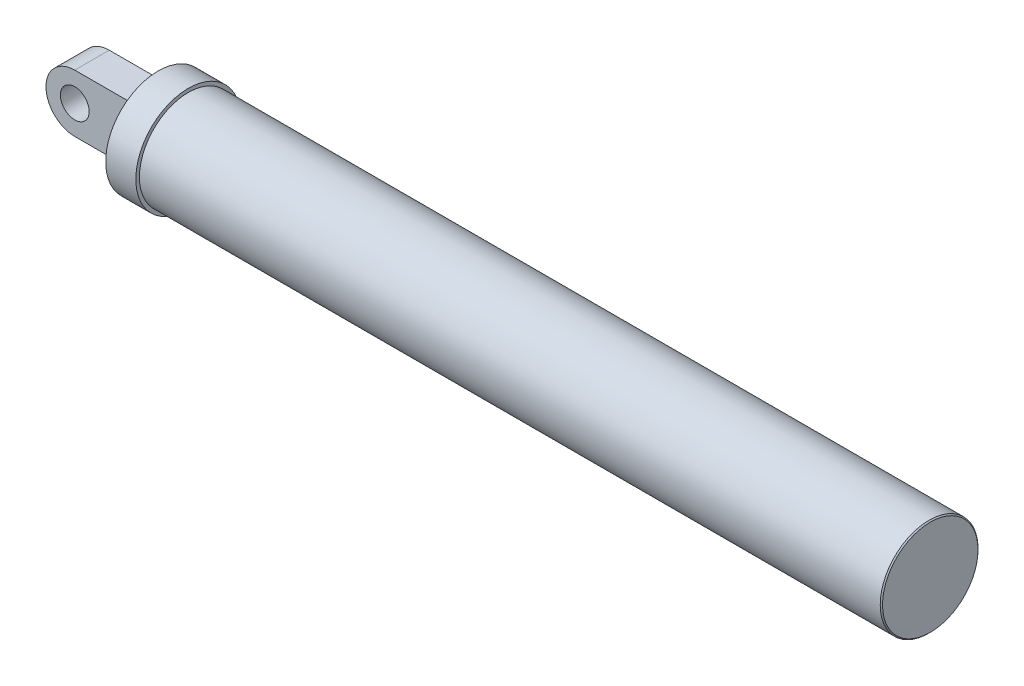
ISO-10303-21;
HEADER;
FILE_DESCRIPTION(('STEP AP214'),'2;1');
FILE_NAME('part.step','',(''),(''),'','','');
FILE_SCHEMA(('AUTOMOTIVE_DESIGN { 1 0 10303 214 1 1 1 1 }'));
ENDSEC;
DATA;
#1=APPLICATION_CONTEXT('core data for automotive mechanical design processes');
#2=APPLICATION_PROTOCOL_DEFINITION('international standard','automotive_design',2000,#1);
#3=PRODUCT_CONTEXT('',#1,'mechanical');
#4=PRODUCT('Part','Part','',(#3));
#5=PRODUCT_RELATED_PRODUCT_CATEGORY('part','',(#4));
#6=PRODUCT_DEFINITION_FORMATION('','',#4);
#7=PRODUCT_DEFINITION_CONTEXT('part definition',#1,'design');
#8=PRODUCT_DEFINITION('design','',#6,#7);
#9=PRODUCT_DEFINITION_SHAPE('','',#8);
#10=(LENGTH_UNIT() NAMED_UNIT(*) SI_UNIT(.MILLI.,.METRE.));
#11=(NAMED_UNIT(*) PLANE_ANGLE_UNIT() SI_UNIT($,.RADIAN.));
#12=(NAMED_UNIT(*) SI_UNIT($,.STERADIAN.) SOLID_ANGLE_UNIT());
#13=UNCERTAINTY_MEASURE_WITH_UNIT(LENGTH_MEASURE(1.E-05),#10,'distance_accuracy_value','');
#14=(GEOMETRIC_REPRESENTATION_CONTEXT(3) GLOBAL_UNCERTAINTY_ASSIGNED_CONTEXT((#13)) GLOBAL_UNIT_ASSIGNED_CONTEXT((#10,
#11,#12)) REPRESENTATION_CONTEXT('',''));
#15=CARTESIAN_POINT('',(0.,0.,0.));
#16=DIRECTION('',(0.,0.,1.));
#17=DIRECTION('',(1.,0.,0.));
#18=AXIS2_PLACEMENT_3D('',#15,#16,#17);
#19=CARTESIAN_POINT('',(0.,0.,0.));
#20=DIRECTION('',(1.,0.,0.));
#21=DIRECTION('',(0.,0.,-1.));
#22=AXIS2_PLACEMENT_3D('',#19,#20,#21);
#23=PLANE('',#22);
#24=CARTESIAN_POINT('',(0.,0.,0.));
#25=DIRECTION('',(1.,0.,0.));
#26=DIRECTION('',(0.,0.,-1.));
#27=AXIS2_PLACEMENT_3D('',#24,#25,#26);
#28=CIRCLE('',#27,91.25);
#29=CARTESIAN_POINT('',(0.,0.,-91.25));
#30=VERTEX_POINT('',#29);
#31=EDGE_CURVE('E113',#30,#30,#28,.T.);
#32=ORIENTED_EDGE('',*,*,#31,.F.);
#33=EDGE_LOOP('',(#32));
#34=FACE_BOUND('',#33,.T.);
#35=DIRECTION('',(0.,0.,-1.));
#36=VECTOR('',#35,1.);
#37=CARTESIAN_POINT('',(0.,-50.,30.));
#38=LINE('',#37,#36);
#39=CARTESIAN_POINT('',(0.,-50.,30.));
#40=VERTEX_POINT('',#39);
#41=CARTESIAN_POINT('',(0.,-50.,-30.));
#42=VERTEX_POINT('',#41);
#43=EDGE_CURVE('E52',#40,#42,#38,.T.);
#44=ORIENTED_EDGE('',*,*,#43,.T.);
#45=DIRECTION('',(0.,1.,0.));
#46=VECTOR('',#45,1.);
#47=CARTESIAN_POINT('',(0.,50.,-30.));
#48=LINE('',#47,#46);
#49=CARTESIAN_POINT('',(0.,50.,-30.));
#50=VERTEX_POINT('',#49);
#51=EDGE_CURVE('E214',#42,#50,#48,.T.);
#52=ORIENTED_EDGE('',*,*,#51,.T.);
#53=DIRECTION('',(0.,0.,-1.));
#54=VECTOR('',#53,1.);
#55=CARTESIAN_POINT('',(0.,50.,30.));
#56=LINE('',#55,#54);
#57=CARTESIAN_POINT('',(0.,50.,30.));
#58=VERTEX_POINT('',#57);
#59=EDGE_CURVE('E98',#58,#50,#56,.T.);
#60=ORIENTED_EDGE('',*,*,#59,.F.);
#61=DIRECTION('',(0.,1.,0.));
#62=VECTOR('',#61,1.);
#63=CARTESIAN_POINT('',(0.,50.,30.));
#64=LINE('',#63,#62);
#65=EDGE_CURVE('E47',#40,#58,#64,.T.);
#66=ORIENTED_EDGE('',*,*,#65,.F.);
#67=EDGE_LOOP('',(#44,#52,#60,#66));
#68=FACE_BOUND('',#67,.T.);
#69=ADVANCED_FACE('F32',(#34,#68),#23,.F.);
#70=CARTESIAN_POINT('',(52.4,0.,0.));
#71=DIRECTION('',(1.,0.,0.));
#72=DIRECTION('',(0.,0.,-1.));
#73=AXIS2_PLACEMENT_3D('',#70,#71,#72);
#74=PLANE('',#73);
#75=CARTESIAN_POINT('',(52.4,0.,0.));
#76=DIRECTION('',(1.,0.,0.));
#77=DIRECTION('',(0.,0.,-1.));
#78=AXIS2_PLACEMENT_3D('',#75,#76,#77);
#79=CIRCLE('',#78,91.25);
#80=CARTESIAN_POINT('',(52.4,0.,-91.25));
#81=VERTEX_POINT('',#80);
#82=EDGE_CURVE('E114',#81,#81,#79,.T.);
#83=ORIENTED_EDGE('',*,*,#82,.T.);
#84=EDGE_LOOP('',(#83));
#85=FACE_BOUND('',#84,.T.);
#86=CARTESIAN_POINT('',(52.4,0.,0.));
#87=DIRECTION('',(1.,0.,0.));
#88=DIRECTION('',(0.,0.,-1.));
#89=AXIS2_PLACEMENT_3D('',#86,#87,#88);
#90=CIRCLE('',#89,85.);
#91=CARTESIAN_POINT('',(52.3999999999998,0.,85.));
#92=VERTEX_POINT('',#91);
#93=EDGE_CURVE('E110',#92,#92,#90,.T.);
#94=ORIENTED_EDGE('',*,*,#93,.F.);
#95=EDGE_LOOP('',(#94));
#96=FACE_BOUND('',#95,.T.);
#97=ADVANCED_FACE('F135',(#85,#96),#74,.T.);
#98=CARTESIAN_POINT('',(52.4,0.,0.));
#99=DIRECTION('',(-1.,0.,0.));
#100=DIRECTION('',(0.,0.,1.));
#101=AXIS2_PLACEMENT_3D('',#98,#99,#100);
#102=CYLINDRICAL_SURFACE('',#101,91.25);
#103=ORIENTED_EDGE('',*,*,#82,.F.);
#104=EDGE_LOOP('',(#103));
#105=FACE_BOUND('',#104,.T.);
#106=ORIENTED_EDGE('',*,*,#31,.T.);
#107=EDGE_LOOP('',(#106));
#108=FACE_BOUND('',#107,.T.);
#109=ADVANCED_FACE('F141',(#105,#108),#102,.T.);
#110=CARTESIAN_POINT('',(1342.4,0.,0.));
#111=DIRECTION('',(-1.,0.,0.));
#112=DIRECTION('',(0.,0.,1.));
#113=AXIS2_PLACEMENT_3D('',#110,#111,#112);
#114=CYLINDRICAL_SURFACE('',#113,85.);
#115=CARTESIAN_POINT('',(1340.4,0.,0.));
#116=DIRECTION('',(1.,0.,0.));
#117=DIRECTION('',(0.,0.,-1.));
#118=AXIS2_PLACEMENT_3D('',#115,#116,#117);
#119=CIRCLE('',#118,85.);
#120=CARTESIAN_POINT('',(1340.4,0.,85.));
#121=VERTEX_POINT('',#120);
#122=EDGE_CURVE('E11',#121,#121,#119,.F.);
#123=CARTESIAN_POINT('',(1340.4,0.,85.));
#124=CARTESIAN_POINT('',(1326.98333333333,0.,85.));
#125=CARTESIAN_POINT('',(1313.56666666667,0.,85.));
#126=CARTESIAN_POINT('',(1286.73333333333,0.,85.));
#127=CARTESIAN_POINT('',(1273.31666666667,0.,85.));
#128=CARTESIAN_POINT('',(1246.48333333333,0.,85.));
#129=CARTESIAN_POINT('',(1233.06666666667,0.,85.));
#130=CARTESIAN_POINT('',(1206.23333333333,0.,85.));
#131=CARTESIAN_POINT('',(1192.81666666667,0.,85.));
#132=CARTESIAN_POINT('',(1165.98333333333,0.,85.));
#133=CARTESIAN_POINT('',(1152.56666666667,0.,85.));
#134=CARTESIAN_POINT('',(1125.73333333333,0.,85.));
#135=CARTESIAN_POINT('',(1112.31666666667,0.,85.));
#136=CARTESIAN_POINT('',(1085.48333333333,0.,85.));
#137=CARTESIAN_POINT('',(1072.06666666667,0.,85.));
#138=CARTESIAN_POINT('',(1045.23333333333,0.,85.));
#139=CARTESIAN_POINT('',(1031.81666666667,0.,85.));
#140=CARTESIAN_POINT('',(1004.98333333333,0.,85.));
#141=CARTESIAN_POINT('',(991.566666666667,0.,85.));
#142=CARTESIAN_POINT('',(964.733333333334,0.,85.));
#143=CARTESIAN_POINT('',(951.316666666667,0.,85.));
#144=CARTESIAN_POINT('',(924.483333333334,0.,85.));
#145=CARTESIAN_POINT('',(911.066666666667,0.,85.));
#146=CARTESIAN_POINT('',(884.233333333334,0.,85.));
#147=CARTESIAN_POINT('',(870.816666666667,0.,85.));
#148=CARTESIAN_POINT('',(843.983333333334,0.,85.));
#149=CARTESIAN_POINT('',(830.566666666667,0.,85.));
#150=CARTESIAN_POINT('',(803.733333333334,0.,85.));
#151=CARTESIAN_POINT('',(790.316666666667,0.,85.));
#152=CARTESIAN_POINT('',(763.483333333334,0.,85.));
#153=CARTESIAN_POINT('',(750.066666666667,0.,85.));
#154=CARTESIAN_POINT('',(723.233333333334,0.,85.));
#155=CARTESIAN_POINT('',(709.816666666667,0.,85.));
#156=CARTESIAN_POINT('',(682.983333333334,0.,85.));
#157=CARTESIAN_POINT('',(669.566666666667,0.,85.));
#158=CARTESIAN_POINT('',(642.733333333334,0.,85.));
#159=CARTESIAN_POINT('',(629.316666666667,0.,85.));
#160=CARTESIAN_POINT('',(602.483333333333,0.,85.));
#161=CARTESIAN_POINT('',(589.066666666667,0.,85.));
#162=CARTESIAN_POINT('',(562.233333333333,0.,85.));
#163=CARTESIAN_POINT('',(548.816666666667,0.,85.));
#164=CARTESIAN_POINT('',(521.983333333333,0.,85.));
#165=CARTESIAN_POINT('',(508.566666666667,0.,85.));
#166=CARTESIAN_POINT('',(481.733333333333,0.,85.));
#167=CARTESIAN_POINT('',(468.316666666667,0.,85.));
#168=CARTESIAN_POINT('',(441.483333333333,0.,85.));
#169=CARTESIAN_POINT('',(428.066666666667,0.,85.));
#170=CARTESIAN_POINT('',(401.233333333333,0.,85.));
#171=CARTESIAN_POINT('',(387.816666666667,0.,85.));
#172=CARTESIAN_POINT('',(360.983333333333,0.,85.));
#173=CARTESIAN_POINT('',(347.566666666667,0.,85.));
#174=CARTESIAN_POINT('',(320.733333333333,0.,85.));
#175=CARTESIAN_POINT('',(307.316666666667,0.,85.));
#176=CARTESIAN_POINT('',(280.483333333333,0.,85.));
#177=CARTESIAN_POINT('',(267.066666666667,0.,85.));
#178=CARTESIAN_POINT('',(240.233333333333,0.,85.));
#179=CARTESIAN_POINT('',(226.816666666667,0.,85.));
#180=CARTESIAN_POINT('',(199.983333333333,0.,85.));
#181=CARTESIAN_POINT('',(186.566666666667,0.,85.));
#182=CARTESIAN_POINT('',(159.733333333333,0.,85.));
#183=CARTESIAN_POINT('',(146.316666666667,0.,85.));
#184=CARTESIAN_POINT('',(119.483333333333,0.,85.));
#185=CARTESIAN_POINT('',(106.066666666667,0.,85.));
#186=CARTESIAN_POINT('',(79.2333333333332,0.,85.));
#187=CARTESIAN_POINT('',(65.8166666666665,0.,85.));
#188=CARTESIAN_POINT('',(52.3999999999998,0.,85.));
#189=B_SPLINE_CURVE_WITH_KNOTS('',3,(#123,#124,#125,#126,#127,#128,#129,#130,#131,#132,#133,
#134,#135,#136,#137,#138,#139,#140,#141,#142,#143,#144,#145,#146,#147,#148,#149,#150,#151,#152,
#153,#154,#155,#156,#157,#158,#159,#160,#161,#162,#163,#164,#165,#166,#167,#168,#169,#170,#171,
#172,#173,#174,#175,#176,#177,#178,#179,#180,#181,#182,#183,#184,#185,#186,#187,#188),
.UNSPECIFIED.,.F.,.F.,(4,2,2,2,2,2,2,2,2,2,2,2,2,2,2,2,2,2,2,2,2,2,2,2,2,2,2,2,2,2,2,2,4),(0.,
40.2499999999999,80.5,120.75,161.,201.25,241.5,281.75,322.,362.25,402.5,442.75,483.,523.25,
563.5,603.75,644.,684.25,724.5,764.75,805.,845.25,885.5,925.75,966.,1006.25,1046.5,1086.75,
1127.,1167.25,1207.5,1247.75,1288.),.UNSPECIFIED.);
#190=EDGE_CURVE('BSEAM131',#121,#92,#189,.T.);
#191=ORIENTED_EDGE('',*,*,#122,.T.);
#192=ORIENTED_EDGE('',*,*,#93,.T.);
#193=ORIENTED_EDGE('',*,*,#190,.T.);
#194=ORIENTED_EDGE('',*,*,#190,.F.);
#195=EDGE_LOOP('',(#191,#193,#192,#194));
#196=FACE_BOUND('',#195,.T.);
#197=ADVANCED_FACE('F131',(#196),#114,.T.);
#198=CARTESIAN_POINT('',(1342.4,0.,0.));
#199=DIRECTION('',(1.,0.,0.));
#200=DIRECTION('',(0.,0.,-1.));
#201=AXIS2_PLACEMENT_3D('',#198,#199,#200);
#202=PLANE('',#201);
#203=CARTESIAN_POINT('',(1342.4,0.,0.));
#204=DIRECTION('',(1.,0.,0.));
#205=DIRECTION('',(0.,0.,-1.));
#206=AXIS2_PLACEMENT_3D('',#203,#204,#205);
#207=CIRCLE('',#206,83.0000000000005);
#208=CARTESIAN_POINT('',(1342.4,0.,-83.0000000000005));
#209=VERTEX_POINT('',#208);
#210=EDGE_CURVE('E40',#209,#209,#207,.T.);
#211=ORIENTED_EDGE('',*,*,#210,.T.);
#212=EDGE_LOOP('',(#211));
#213=FACE_BOUND('',#212,.T.);
#214=ADVANCED_FACE('F121',(#213),#202,.T.);
#215=CARTESIAN_POINT('',(1342.4,0.,0.));
#216=DIRECTION('',(-1.,0.,0.));
#217=DIRECTION('',(0.,0.,1.));
#218=AXIS2_PLACEMENT_3D('',#215,#216,#217);
#219=CONICAL_SURFACE('',#218,83.0000000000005,0.785398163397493);
#220=ORIENTED_EDGE('',*,*,#122,.F.);
#221=EDGE_LOOP('',(#220));
#222=FACE_BOUND('',#221,.T.);
#223=ORIENTED_EDGE('',*,*,#210,.F.);
#224=EDGE_LOOP('',(#223));
#225=FACE_BOUND('',#224,.T.);
#226=ADVANCED_FACE('F34',(#222,#225),#219,.T.);
#227=CARTESIAN_POINT('',(-115.,0.,30.));
#228=DIRECTION('',(0.,0.,1.));
#229=DIRECTION('',(1.,0.,0.));
#230=AXIS2_PLACEMENT_3D('',#227,#228,#229);
#231=PLANE('',#230);
#232=CARTESIAN_POINT('',(-115.,0.,30.));
#233=DIRECTION('',(0.,0.,1.));
#234=DIRECTION('',(1.,0.,0.));
#235=AXIS2_PLACEMENT_3D('',#232,#233,#234);
#236=CIRCLE('',#235,50.);
#237=CARTESIAN_POINT('',(-115.,50.,30.));
#238=VERTEX_POINT('',#237);
#239=CARTESIAN_POINT('',(-115.,-50.,30.));
#240=VERTEX_POINT('',#239);
#241=EDGE_CURVE('E78',#238,#240,#236,.T.);
#242=ORIENTED_EDGE('',*,*,#241,.T.);
#243=DIRECTION('',(1.,0.,0.));
#244=VECTOR('',#243,1.);
#245=CARTESIAN_POINT('',(-115.,-50.,30.));
#246=LINE('',#245,#244);
#247=EDGE_CURVE('E71',#240,#40,#246,.T.);
#248=ORIENTED_EDGE('',*,*,#247,.T.);
#249=ORIENTED_EDGE('',*,*,#65,.T.);
#250=DIRECTION('',(-1.,0.,0.));
#251=VECTOR('',#250,1.);
#252=CARTESIAN_POINT('',(-115.,50.,30.));
#253=LINE('',#252,#251);
#254=EDGE_CURVE('E84',#58,#238,#253,.T.);
#255=ORIENTED_EDGE('',*,*,#254,.T.);
#256=EDGE_LOOP('',(#242,#248,#249,#255));
#257=FACE_BOUND('',#256,.T.);
#258=CARTESIAN_POINT('',(-115.,0.,30.));
#259=DIRECTION('',(0.,0.,1.));
#260=DIRECTION('',(1.,0.,0.));
#261=AXIS2_PLACEMENT_3D('',#258,#259,#260);
#262=CIRCLE('',#261,25.);
#263=CARTESIAN_POINT('',(-90.,0.,30.));
#264=VERTEX_POINT('',#263);
#265=EDGE_CURVE('E200',#264,#264,#262,.T.);
#266=ORIENTED_EDGE('',*,*,#265,.F.);
#267=EDGE_LOOP('',(#266));
#268=FACE_BOUND('',#267,.T.);
#269=ADVANCED_FACE('F81',(#257,#268),#231,.T.);
#270=CARTESIAN_POINT('',(-115.,0.,-30.));
#271=DIRECTION('',(0.,0.,1.));
#272=DIRECTION('',(1.,0.,0.));
#273=AXIS2_PLACEMENT_3D('',#270,#271,#272);
#274=PLANE('',#273);
#275=CARTESIAN_POINT('',(-115.,0.,-30.));
#276=DIRECTION('',(0.,0.,1.));
#277=DIRECTION('',(1.,0.,0.));
#278=AXIS2_PLACEMENT_3D('',#275,#276,#277);
#279=CIRCLE('',#278,50.);
#280=CARTESIAN_POINT('',(-115.,50.,-30.));
#281=VERTEX_POINT('',#280);
#282=CARTESIAN_POINT('',(-115.,-50.,-30.));
#283=VERTEX_POINT('',#282);
#284=EDGE_CURVE('E92',#281,#283,#279,.T.);
#285=ORIENTED_EDGE('',*,*,#284,.F.);
#286=DIRECTION('',(-1.,0.,0.));
#287=VECTOR('',#286,1.);
#288=CARTESIAN_POINT('',(-115.,50.,-30.));
#289=LINE('',#288,#287);
#290=EDGE_CURVE('E88',#50,#281,#289,.T.);
#291=ORIENTED_EDGE('',*,*,#290,.F.);
#292=ORIENTED_EDGE('',*,*,#51,.F.);
#293=DIRECTION('',(1.,0.,0.));
#294=VECTOR('',#293,1.);
#295=CARTESIAN_POINT('',(-115.,-50.,-30.));
#296=LINE('',#295,#294);
#297=EDGE_CURVE('E212',#283,#42,#296,.T.);
#298=ORIENTED_EDGE('',*,*,#297,.F.);
#299=EDGE_LOOP('',(#285,#291,#292,#298));
#300=FACE_BOUND('',#299,.T.);
#301=CARTESIAN_POINT('',(-115.,0.,-30.));
#302=DIRECTION('',(0.,0.,1.));
#303=DIRECTION('',(1.,0.,0.));
#304=AXIS2_PLACEMENT_3D('',#301,#302,#303);
#305=CIRCLE('',#304,25.);
#306=CARTESIAN_POINT('',(-90.,0.,-30.));
#307=VERTEX_POINT('',#306);
#308=EDGE_CURVE('E203',#307,#307,#305,.T.);
#309=ORIENTED_EDGE('',*,*,#308,.T.);
#310=EDGE_LOOP('',(#309));
#311=FACE_BOUND('',#310,.T.);
#312=ADVANCED_FACE('F129',(#300,#311),#274,.F.);
#313=CARTESIAN_POINT('',(-115.,0.,30.));
#314=DIRECTION('',(0.,0.,-1.));
#315=DIRECTION('',(-1.,0.,0.));
#316=AXIS2_PLACEMENT_3D('',#313,#314,#315);
#317=CYLINDRICAL_SURFACE('',#316,50.);
#318=ORIENTED_EDGE('',*,*,#284,.T.);
#319=DIRECTION('',(0.,0.,-1.));
#320=VECTOR('',#319,1.);
#321=CARTESIAN_POINT('',(-115.,-50.,30.));
#322=LINE('',#321,#320);
#323=EDGE_CURVE('E75',#240,#283,#322,.T.);
#324=ORIENTED_EDGE('',*,*,#323,.F.);
#325=ORIENTED_EDGE('',*,*,#241,.F.);
#326=DIRECTION('',(0.,0.,-1.));
#327=VECTOR('',#326,1.);
#328=CARTESIAN_POINT('',(-115.,50.,30.));
#329=LINE('',#328,#327);
#330=EDGE_CURVE('E210',#238,#281,#329,.T.);
#331=ORIENTED_EDGE('',*,*,#330,.T.);
#332=EDGE_LOOP('',(#318,#324,#325,#331));
#333=FACE_BOUND('',#332,.T.);
#334=ADVANCED_FACE('F90',(#333),#317,.T.);
#335=CARTESIAN_POINT('',(-115.,-50.,30.));
#336=DIRECTION('',(0.,1.,0.));
#337=DIRECTION('',(-1.,0.,0.));
#338=AXIS2_PLACEMENT_3D('',#335,#336,#337);
#339=PLANE('',#338);
#340=ORIENTED_EDGE('',*,*,#297,.T.);
#341=ORIENTED_EDGE('',*,*,#43,.F.);
#342=ORIENTED_EDGE('',*,*,#247,.F.);
#343=ORIENTED_EDGE('',*,*,#323,.T.);
#344=EDGE_LOOP('',(#340,#341,#342,#343));
#345=FACE_BOUND('',#344,.T.);
#346=ADVANCED_FACE('F73',(#345),#339,.F.);
#347=CARTESIAN_POINT('',(-115.,50.,30.));
#348=DIRECTION('',(0.,-1.,0.));
#349=DIRECTION('',(1.,0.,0.));
#350=AXIS2_PLACEMENT_3D('',#347,#348,#349);
#351=PLANE('',#350);
#352=ORIENTED_EDGE('',*,*,#290,.T.);
#353=ORIENTED_EDGE('',*,*,#330,.F.);
#354=ORIENTED_EDGE('',*,*,#254,.F.);
#355=ORIENTED_EDGE('',*,*,#59,.T.);
#356=EDGE_LOOP('',(#352,#353,#354,#355));
#357=FACE_BOUND('',#356,.T.);
#358=ADVANCED_FACE('F185',(#357),#351,.F.);
#359=CARTESIAN_POINT('',(-115.,0.,30.));
#360=DIRECTION('',(0.,0.,-1.));
#361=DIRECTION('',(-1.,0.,0.));
#362=AXIS2_PLACEMENT_3D('',#359,#360,#361);
#363=CYLINDRICAL_SURFACE('',#362,25.);
#364=ORIENTED_EDGE('',*,*,#265,.T.);
#365=EDGE_LOOP('',(#364));
#366=FACE_BOUND('',#365,.T.);
#367=ORIENTED_EDGE('',*,*,#308,.F.);
#368=EDGE_LOOP('',(#367));
#369=FACE_BOUND('',#368,.T.);
#370=ADVANCED_FACE('F188',(#366,#369),#363,.F.);
#371=CLOSED_SHELL('',(#69,#97,#109,#197,#214,#226,#269,#312,#334,#346,#358,#370));
#372=CARTESIAN_POINT('',(926.000813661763,0.,0.));
#373=DIRECTION('',(-1.,0.,0.));
#374=DIRECTION('',(0.,0.,1.));
#375=AXIS2_PLACEMENT_3D('',#372,#373,#374);
#376=PLANE('',#375);
#377=CARTESIAN_POINT('',(926.000813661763,0.,0.));
#378=DIRECTION('',(-1.,0.,0.));
#379=DIRECTION('',(0.,0.,1.));
#380=AXIS2_PLACEMENT_3D('',#377,#378,#379);
#381=CIRCLE('',#380,65.3);
#382=CARTESIAN_POINT('',(926.000813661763,0.,65.3));
#383=VERTEX_POINT('',#382);
#384=EDGE_CURVE('E93',#383,#383,#381,.T.);
#385=ORIENTED_EDGE('',*,*,#384,.T.);
#386=EDGE_LOOP('',(#385));
#387=FACE_BOUND('',#386,.T.);
#388=ADVANCED_FACE('F160',(#387),#376,.T.);
#389=CARTESIAN_POINT('',(12.5942941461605,70.,0.));
#390=DIRECTION('',(1.,0.,0.));
#391=DIRECTION('',(0.,0.,-1.));
#392=AXIS2_PLACEMENT_3D('',#389,#390,#391);
#393=PLANE('',#392);
#394=CARTESIAN_POINT('',(12.5942941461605,0.,0.));
#395=DIRECTION('',(-1.,0.,0.));
#396=DIRECTION('',(0.,0.,1.));
#397=AXIS2_PLACEMENT_3D('',#394,#395,#396);
#398=CIRCLE('',#397,70.);
#399=CARTESIAN_POINT('',(12.5942941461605,0.,70.));
#400=VERTEX_POINT('',#399);
#401=EDGE_CURVE('E107',#400,#400,#398,.T.);
#402=ORIENTED_EDGE('',*,*,#401,.F.);
#403=EDGE_LOOP('',(#402));
#404=FACE_BOUND('',#403,.T.);
#405=ADVANCED_FACE('F163',(#404),#393,.T.);
#406=CARTESIAN_POINT('',(0.,0.,0.));
#407=DIRECTION('',(-1.,0.,0.));
#408=DIRECTION('',(0.,0.,1.));
#409=AXIS2_PLACEMENT_3D('',#406,#407,#408);
#410=CYLINDRICAL_SURFACE('',#409,70.);
#411=ORIENTED_EDGE('',*,*,#401,.T.);
#412=EDGE_LOOP('',(#411));
#413=FACE_BOUND('',#412,.T.);
#414=CARTESIAN_POINT('',(1218.4,0.,0.));
#415=DIRECTION('',(-1.,0.,0.));
#416=DIRECTION('',(0.,0.,1.));
#417=AXIS2_PLACEMENT_3D('',#414,#415,#416);
#418=CIRCLE('',#417,70.);
#419=CARTESIAN_POINT('',(1218.4,0.,70.));
#420=VERTEX_POINT('',#419);
#421=EDGE_CURVE('E104',#420,#420,#418,.T.);
#422=ORIENTED_EDGE('',*,*,#421,.F.);
#423=EDGE_LOOP('',(#422));
#424=FACE_BOUND('',#423,.T.);
#425=ADVANCED_FACE('F168',(#413,#424),#410,.F.);
#426=CARTESIAN_POINT('',(1218.4,65.3,0.));
#427=DIRECTION('',(-1.,0.,0.));
#428=DIRECTION('',(0.,0.,1.));
#429=AXIS2_PLACEMENT_3D('',#426,#427,#428);
#430=PLANE('',#429);
#431=ORIENTED_EDGE('',*,*,#421,.T.);
#432=EDGE_LOOP('',(#431));
#433=FACE_BOUND('',#432,.T.);
#434=CARTESIAN_POINT('',(1218.4,0.,0.));
#435=DIRECTION('',(-1.,0.,0.));
#436=DIRECTION('',(0.,0.,1.));
#437=AXIS2_PLACEMENT_3D('',#434,#435,#436);
#438=CIRCLE('',#437,65.3);
#439=CARTESIAN_POINT('',(1218.4,0.,65.3));
#440=VERTEX_POINT('',#439);
#441=EDGE_CURVE('E96',#440,#440,#438,.T.);
#442=ORIENTED_EDGE('',*,*,#441,.F.);
#443=EDGE_LOOP('',(#442));
#444=FACE_BOUND('',#443,.T.);
#445=ADVANCED_FACE('F172',(#433,#444),#430,.T.);
#446=CARTESIAN_POINT('',(0.,0.,0.));
#447=DIRECTION('',(-1.,0.,0.));
#448=DIRECTION('',(0.,0.,1.));
#449=AXIS2_PLACEMENT_3D('',#446,#447,#448);
#450=CYLINDRICAL_SURFACE('',#449,65.3);
#451=ORIENTED_EDGE('',*,*,#441,.T.);
#452=EDGE_LOOP('',(#451));
#453=FACE_BOUND('',#452,.T.);
#454=ORIENTED_EDGE('',*,*,#384,.F.);
#455=EDGE_LOOP('',(#454));
#456=FACE_BOUND('',#455,.T.);
#457=ADVANCED_FACE('F176',(#453,#456),#450,.T.);
#458=CLOSED_SHELL('',(#388,#405,#425,#445,#457));
#459=ORIENTED_CLOSED_SHELL('',*,#458,.T.);
#460=BREP_WITH_VOIDS('B2',#371,(#459));
#461=ADVANCED_BREP_SHAPE_REPRESENTATION('',(#18,#460),#14);
#462=SHAPE_DEFINITION_REPRESENTATION(#9,#461);
ENDSEC;
END-ISO-10303-21;
